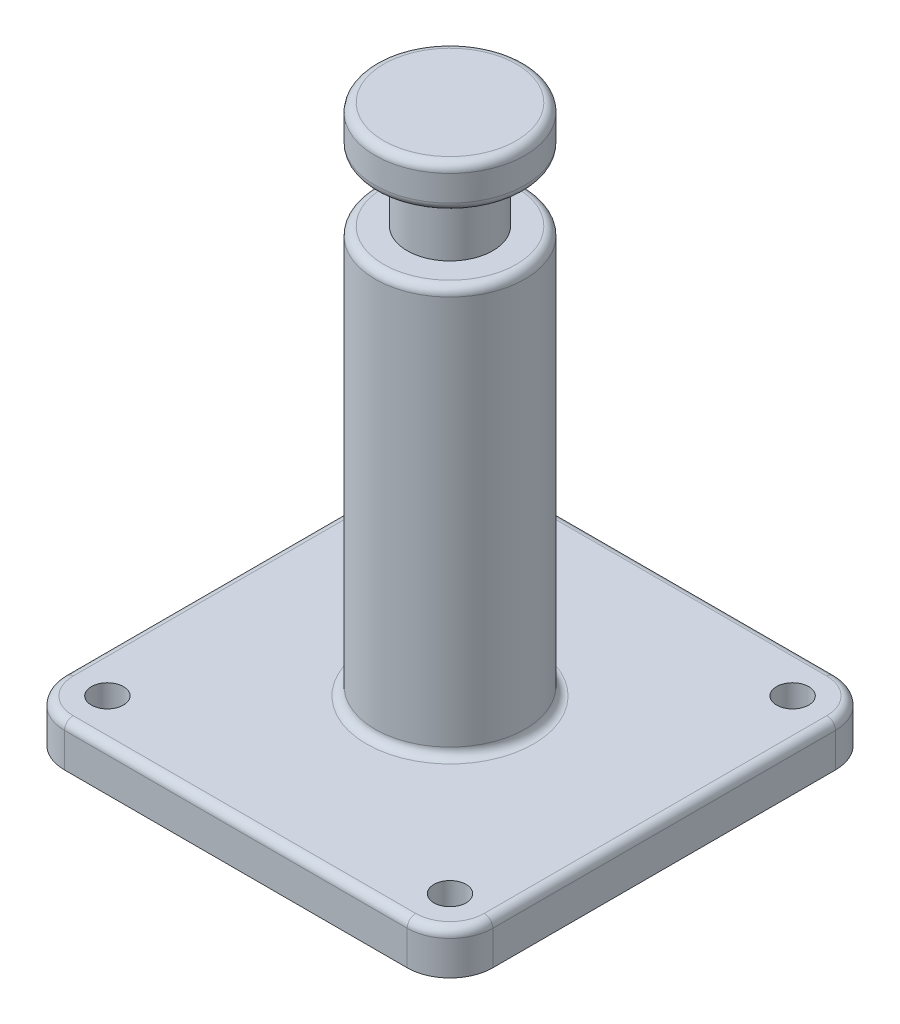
from build123d import *

# Parameters (mm, degrees)
SKETCH1_R      = 4.7625
EXTRUDE1_DEPTH = 12.7
FILLET2_R      = 2.54


with BuildPart() as part:
    # Sketch1 → Extrude1 (new body)
    with BuildSketch(Plane(origin=(0, 0, 0), x_dir=(1, 0, 0), z_dir=(0, 1, 0))):
        with BuildLine():
            Line((-50.8, -63.5), (50.8, -63.5))
            ThreePointArc((50.8, -63.5), (59.780256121, -59.780256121), (63.5, -50.8))
            Line((63.5, -50.8), (63.5, 50.8))
            ThreePointArc((63.5, 50.8), (59.780256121, 59.780256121), (50.8, 63.5))
            Line((50.8, 63.5), (-50.8, 63.5))
            ThreePointArc((-50.8, 63.5), (-59.780256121, 59.780256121), (-63.5, 50.8))
            Line((-63.5, 50.8), (-63.5, -50.8))
            ThreePointArc((-63.5, -50.8), (-59.780256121, -59.780256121), (-50.8, -63.5))
        make_face()
        with Locations(Location((-50.8, 50.8, 0), (0, 0, 270))):
            Circle(SKETCH1_R, mode=Mode.SUBTRACT)
        with Locations(Location((50.8, 50.8, 0), (0, 0, 270))):
            Circle(SKETCH1_R, mode=Mode.SUBTRACT)
        with Locations(Location((50.8, -50.8, 0), (0, 0, 270))):
            Circle(SKETCH1_R, mode=Mode.SUBTRACT)
        with Locations(Location((-50.8, -50.8, 0), (0, 0, 270))):
            Circle(SKETCH1_R, mode=Mode.SUBTRACT)
    extrude(amount=EXTRUDE1_DEPTH)

    # Sketch3 → Revolve1 (revolve)
    with BuildSketch(Plane.XY, mode=Mode.PRIVATE) as revolve1_sk:
        Polygon((0, 165.1), (22.225, 165.1), (22.225, 152.4), (12.7, 152.4), (12.7, 133.35), (22.225, 133.35), (22.225, 12.7), (0, 12.7), align=None)
    revolve(revolve1_sk.sketch.rotate(Axis((0, 0, 0), (0, 1, 0)), 90), axis=Axis((0, 0, 0), (0, 1, 0)))

    # Fillet2
    fillet2_edges = [part.edges().sort_by_distance(p)[0] for p in [
        (59.780256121, 12.7, -59.780256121),
        (0, 12.7, -63.5),
        (-59.780256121, 12.7, -59.780256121),
        (-63.5, 12.7, 0),
        (-59.780256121, 12.7, 59.780256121),
        (0, 12.7, 63.5),
        (0, 12.7, 22.225),
        (0, 165.1, 22.225),
        (0, 152.4, 22.225),
        (0, 133.35, 22.225),
        (59.780256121, 12.7, 59.780256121),
        (63.5, 12.7, 0),
    ]]
    fillet(fillet2_edges, radius=FILLET2_R)


solid = part.part
